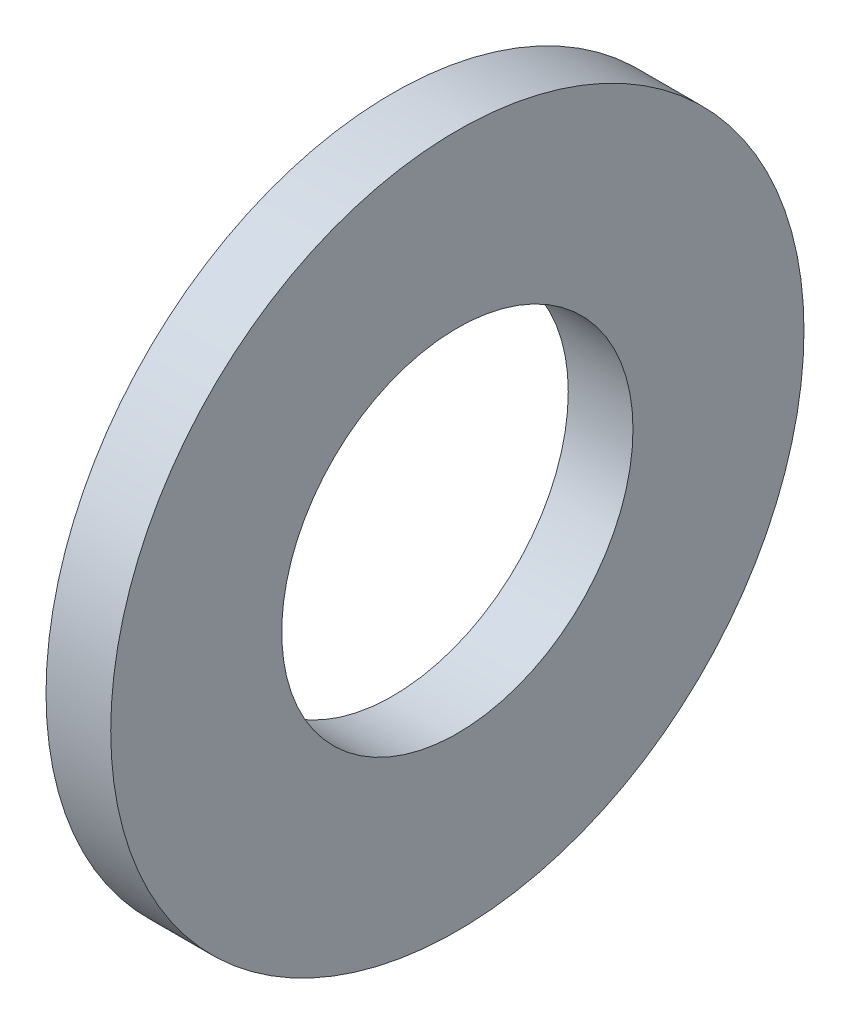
from build123d import *

# Parameters (mm, degrees)
SKETCH1_R           = 9.525
SKETCH1_R_2         = 4.826
BOSS_EXTRUDE1_DEPTH = 1.778


with BuildPart() as part:
    # Sketch1 → Boss-Extrude1 (new body)
    with BuildSketch(Plane(origin=(0, 0, 0), x_dir=(0, 0, -1), z_dir=(1, 0, 0))):
        Circle(SKETCH1_R)
        Circle(SKETCH1_R_2, mode=Mode.SUBTRACT)
    extrude(amount=BOSS_EXTRUDE1_DEPTH)


solid = part.part
